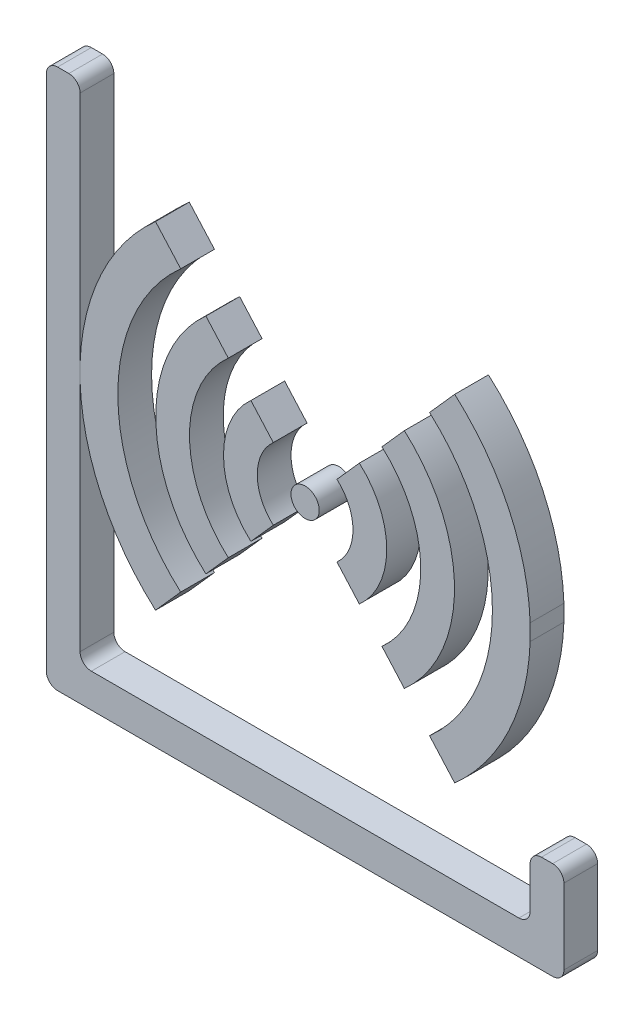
from build123d import *

# Parameters (mm, degrees)
BOSS_EXTRUDE1_DEPTH   = 3
BOSS_EXTRUDE1_2_DEPTH = 3
BOSS_EXTRUDE1_3_DEPTH = 3
BOSS_EXTRUDE1_4_DEPTH = 3
BOSS_EXTRUDE1_5_DEPTH = 3
BOSS_EXTRUDE1_6_DEPTH = 3
BOSS_EXTRUDE1_7_DEPTH = 3
SKETCH1_R             = 1.254988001
BOSS_EXTRUDE1_8_DEPTH = 3
FILLET1_R             = 1


with BuildPart() as part:
    # Sketch1 → Boss-Extrude1 (new body)
    with BuildSketch(Plane.XY):
        with BuildLine():
            Line((20, -0.724275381), (20, 0.724275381))
            ThreePointArc((20, 0.724275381), (18.105394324, 8.527559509), (13.295986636, 14.957984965))
            Line((13.295986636, 14.957984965), (11.058177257, 12.440449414))
            ThreePointArc((11.058177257, 12.440449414), (16.644760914, 0), (11.058177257, -12.440449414))
            Line((11.058177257, -12.440449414), (13.295986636, -14.957984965))
            ThreePointArc((13.295986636, -14.957984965), (18.105394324, -8.527559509), (20, -0.724275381))
        make_face()
    extrude(amount=BOSS_EXTRUDE1_DEPTH)


with BuildPart() as body_2:
    # Sketch1 → Boss-Extrude1 2 (new body)
    with BuildSketch(Plane.XY):
        with BuildLine():
            Line((-20, 0.724275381), (-20, 22.5))
            Line((-20, 22.5), (-23, 22.5))
            Line((-23, 22.5), (-23, -25.5))
            Line((-23, -25.5), (23, -25.5))
            Line((23, -25.5), (23, -16.815425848))
            Line((23, -16.815425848), (20, -16.815425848))
            Line((20, -16.815425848), (20, -22.5))
            Line((20, -22.5), (-20, -22.5))
            Line((-20, -22.5), (-20, -0.724275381))
            ThreePointArc((-20, -0.724275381), (-20.013110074, 0), (-20, 0.724275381))
        make_face()
    extrude(amount=BOSS_EXTRUDE1_2_DEPTH)

    # Fillet1
    fillet1_edges = [body_2.edges().sort_by_distance(p)[0] for p in [
        (-20, -22.5, 1.5),
        (20, -22.5, 1.5),
        (20, -16.815425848, 1.5),
        (23, -16.815425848, 1.5),
        (23, -25.5, 1.5),
        (-23, -25.5, 1.5),
        (-23, 22.5, 1.5),
        (-20, 22.5, 1.5),
    ]]
    fillet(fillet1_edges, radius=FILLET1_R)


with BuildPart() as body_3:
    # Sketch1 → Boss-Extrude1 3 (new body)
    with BuildSketch(Plane.XY):
        with BuildLine():
            ThreePointArc((-13.295986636, 14.957984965), (-18.105394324, 8.527559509), (-20, 0.724275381))
            Line((-20, 0.724275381), (-20, -0.724275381))
            ThreePointArc((-20, -0.724275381), (-18.105394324, -8.527559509), (-13.295986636, -14.957984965))
            Line((-13.295986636, -14.957984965), (-11.058177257, -12.440449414))
            ThreePointArc((-11.058177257, -12.440449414), (-16.644760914, 0), (-11.058177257, 12.440449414))
            Line((-11.058177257, 12.440449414), (-13.295986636, 14.957984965))
        make_face()
    extrude(amount=BOSS_EXTRUDE1_3_DEPTH)


with BuildPart() as body_4:
    # Sketch1 → Boss-Extrude1 4 (new body)
    with BuildSketch(Plane.XY):
        with BuildLine():
            ThreePointArc((-8.820367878, 9.922913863), (-13.276411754, 0), (-8.820367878, -9.922913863))
            Line((-8.820367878, -9.922913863), (-6.827276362, -7.680685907))
            ThreePointArc((-6.827276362, -7.680685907), (-10.276411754, 0), (-6.827276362, 7.680685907))
            Line((-6.827276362, 7.680685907), (-8.820367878, 9.922913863))
        make_face()
    extrude(amount=BOSS_EXTRUDE1_4_DEPTH)


with BuildPart() as body_5:
    # Sketch1 → Boss-Extrude1 5 (new body)
    with BuildSketch(Plane.XY):
        with BuildLine():
            ThreePointArc((8.820367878, -9.922913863), (13.276411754, 0), (8.820367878, 9.922913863))
            Line((8.820367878, 9.922913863), (6.827276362, 7.680685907))
            ThreePointArc((6.827276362, 7.680685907), (10.276411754, 0), (6.827276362, -7.680685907))
            Line((6.827276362, -7.680685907), (8.820367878, -9.922913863))
        make_face()
    extrude(amount=BOSS_EXTRUDE1_5_DEPTH)


with BuildPart() as body_6:
    # Sketch1 → Boss-Extrude1 6 (new body)
    with BuildSketch(Plane.XY):
        with BuildLine():
            ThreePointArc((-2.826860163, -3.180217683), (-4.254988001, 0), (-2.826860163, 3.180217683))
            Line((-2.826860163, 3.180217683), (-4.819951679, 5.422445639))
            ThreePointArc((-4.819951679, 5.422445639), (-7.254988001, 0), (-4.819951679, -5.422445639))
            Line((-4.819951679, -5.422445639), (-2.826860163, -3.180217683))
        make_face()
    extrude(amount=BOSS_EXTRUDE1_6_DEPTH)


with BuildPart() as body_7:
    # Sketch1 → Boss-Extrude1 7 (new body)
    with BuildSketch(Plane.XY):
        with BuildLine():
            Line((4.819951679, 5.422445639), (2.826860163, 3.180217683))
            ThreePointArc((2.826860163, 3.180217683), (4.254988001, 0), (2.826860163, -3.180217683))
            Line((2.826860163, -3.180217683), (4.819951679, -5.422445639))
            ThreePointArc((4.819951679, -5.422445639), (7.254988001, 0), (4.819951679, 5.422445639))
        make_face()
    extrude(amount=BOSS_EXTRUDE1_7_DEPTH)


with BuildPart() as body_8:
    # Sketch1 → Boss-Extrude1 8 (new body)
    with BuildSketch(Plane.XY):
        Circle(SKETCH1_R)
    extrude(amount=BOSS_EXTRUDE1_8_DEPTH)


solid = Compound([part.part, body_2.part, body_3.part, body_4.part, body_5.part, body_6.part, body_7.part, body_8.part])
